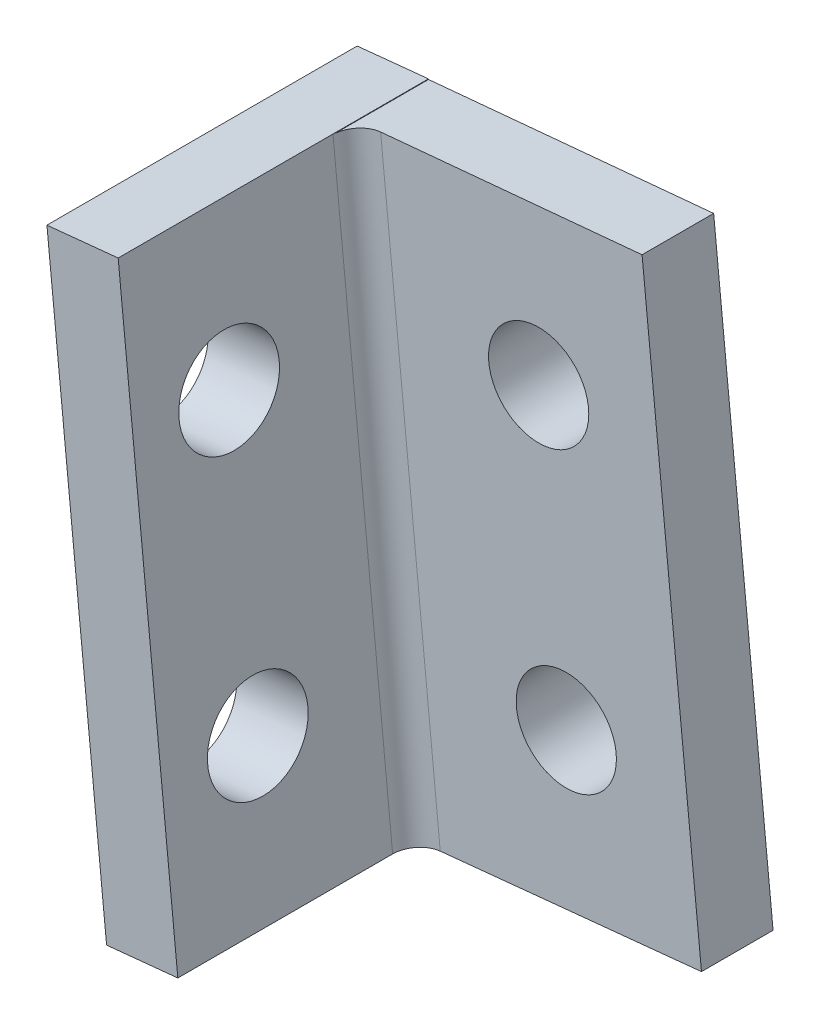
ISO-10303-21;
HEADER;
FILE_DESCRIPTION(('STEP AP214'),'2;1');
FILE_NAME('part.step','',(''),(''),'','','');
FILE_SCHEMA(('AUTOMOTIVE_DESIGN { 1 0 10303 214 1 1 1 1 }'));
ENDSEC;
DATA;
#1=APPLICATION_CONTEXT('core data for automotive mechanical design processes');
#2=APPLICATION_PROTOCOL_DEFINITION('international standard','automotive_design',2000,#1);
#3=PRODUCT_CONTEXT('',#1,'mechanical');
#4=PRODUCT('Part','Part','',(#3));
#5=PRODUCT_RELATED_PRODUCT_CATEGORY('part','',(#4));
#6=PRODUCT_DEFINITION_FORMATION('','',#4);
#7=PRODUCT_DEFINITION_CONTEXT('part definition',#1,'design');
#8=PRODUCT_DEFINITION('design','',#6,#7);
#9=PRODUCT_DEFINITION_SHAPE('','',#8);
#10=(LENGTH_UNIT() NAMED_UNIT(*) SI_UNIT(.MILLI.,.METRE.));
#11=(NAMED_UNIT(*) PLANE_ANGLE_UNIT() SI_UNIT($,.RADIAN.));
#12=(NAMED_UNIT(*) SI_UNIT($,.STERADIAN.) SOLID_ANGLE_UNIT());
#13=UNCERTAINTY_MEASURE_WITH_UNIT(LENGTH_MEASURE(1.E-05),#10,'distance_accuracy_value','');
#14=(GEOMETRIC_REPRESENTATION_CONTEXT(3) GLOBAL_UNCERTAINTY_ASSIGNED_CONTEXT((#13)) GLOBAL_UNIT_ASSIGNED_CONTEXT((#10,
#11,#12)) REPRESENTATION_CONTEXT('',''));
#15=CARTESIAN_POINT('',(0.,0.,0.));
#16=DIRECTION('',(0.,0.,1.));
#17=DIRECTION('',(1.,0.,0.));
#18=AXIS2_PLACEMENT_3D('',#15,#16,#17);
#19=CARTESIAN_POINT('',(0.,0.,3.));
#20=DIRECTION('',(0.,0.,1.));
#21=DIRECTION('',(1.,0.,0.));
#22=AXIS2_PLACEMENT_3D('',#19,#20,#21);
#23=PLANE('',#22);
#24=DIRECTION('',(-0.995676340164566,-0.0928903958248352,0.));
#25=VECTOR('',#24,1.);
#26=CARTESIAN_POINT('',(-90.0648548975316,46.1301648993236,3.));
#27=LINE('',#26,#25);
#28=CARTESIAN_POINT('',(-90.0648548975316,46.1301648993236,3.));
#29=VERTEX_POINT('',#28);
#30=CARTESIAN_POINT('',(-101.017193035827,45.108380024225,3.));
#31=VERTEX_POINT('',#30);
#32=EDGE_CURVE('E156',#29,#31,#27,.T.);
#33=ORIENTED_EDGE('',*,*,#32,.T.);
#34=DIRECTION('',(-0.0999999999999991,0.99498743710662,0.));
#35=VECTOR('',#34,1.);
#36=CARTESIAN_POINT('',(-98.5200502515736,20.2621230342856,3.));
#37=LINE('',#36,#35);
#38=CARTESIAN_POINT('',(-98.5200502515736,20.2621230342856,3.));
#39=VERTEX_POINT('',#38);
#40=EDGE_CURVE('E62',#31,#39,#37,.F.);
#41=ORIENTED_EDGE('',*,*,#40,.T.);
#42=DIRECTION('',(0.99498743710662,0.0999999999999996,0.));
#43=VECTOR('',#42,1.);
#44=CARTESIAN_POINT('',(-102.5,19.8621230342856,3.));
#45=LINE('',#44,#43);
#46=CARTESIAN_POINT('',(-87.5751884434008,21.3621230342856,3.));
#47=VERTEX_POINT('',#46);
#48=EDGE_CURVE('E158',#39,#47,#45,.T.);
#49=ORIENTED_EDGE('',*,*,#48,.T.);
#50=DIRECTION('',(-0.100015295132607,0.994985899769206,0.));
#51=VECTOR('',#50,1.);
#52=CARTESIAN_POINT('',(-87.5751884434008,21.3621230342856,3.));
#53=LINE('',#52,#51);
#54=EDGE_CURVE('E161',#47,#29,#53,.T.);
#55=ORIENTED_EDGE('',*,*,#54,.T.);
#56=EDGE_LOOP('',(#33,#41,#49,#55));
#57=FACE_BOUND('',#56,.T.);
#58=CARTESIAN_POINT('',(-94.3968404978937,39.2338656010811,3.));
#59=DIRECTION('',(0.,0.,1.));
#60=DIRECTION('',(1.,0.,0.));
#61=AXIS2_PLACEMENT_3D('',#58,#59,#60);
#62=CIRCLE('',#61,2.1);
#63=CARTESIAN_POINT('',(-92.2968404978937,39.2338656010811,3.));
#64=VERTEX_POINT('',#63);
#65=EDGE_CURVE('E150',#64,#64,#62,.T.);
#66=ORIENTED_EDGE('',*,*,#65,.F.);
#67=EDGE_LOOP('',(#66));
#68=FACE_BOUND('',#67,.T.);
#69=CARTESIAN_POINT('',(-93.2394907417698,27.2898067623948,3.));
#70=DIRECTION('',(0.,0.,1.));
#71=DIRECTION('',(1.,0.,0.));
#72=AXIS2_PLACEMENT_3D('',#69,#70,#71);
#73=CIRCLE('',#72,2.1);
#74=CARTESIAN_POINT('',(-91.1394907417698,27.2898067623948,3.));
#75=VERTEX_POINT('',#74);
#76=EDGE_CURVE('E144',#75,#75,#73,.T.);
#77=ORIENTED_EDGE('',*,*,#76,.F.);
#78=EDGE_LOOP('',(#77));
#79=FACE_BOUND('',#78,.T.);
#80=ADVANCED_FACE('F41',(#57,#68,#79),#23,.T.);
#81=CARTESIAN_POINT('',(0.,0.,0.));
#82=DIRECTION('',(0.,0.,1.));
#83=DIRECTION('',(1.,0.,0.));
#84=AXIS2_PLACEMENT_3D('',#81,#82,#83);
#85=PLANE('',#84);
#86=DIRECTION('',(-0.100015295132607,0.994985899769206,0.));
#87=VECTOR('',#86,1.);
#88=CARTESIAN_POINT('',(-87.5751884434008,21.3621230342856,0.));
#89=LINE('',#88,#87);
#90=CARTESIAN_POINT('',(-87.5751884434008,21.3621230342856,0.));
#91=VERTEX_POINT('',#90);
#92=CARTESIAN_POINT('',(-90.0648548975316,46.1301648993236,0.));
#93=VERTEX_POINT('',#92);
#94=EDGE_CURVE('E159',#91,#93,#89,.T.);
#95=ORIENTED_EDGE('',*,*,#94,.F.);
#96=DIRECTION('',(0.99498743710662,0.0999999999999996,0.));
#97=VECTOR('',#96,1.);
#98=CARTESIAN_POINT('',(-102.5,19.8621230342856,0.));
#99=LINE('',#98,#97);
#100=CARTESIAN_POINT('',(-102.5,19.8621230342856,0.));
#101=VERTEX_POINT('',#100);
#102=EDGE_CURVE('E168',#101,#91,#99,.T.);
#103=ORIENTED_EDGE('',*,*,#102,.F.);
#104=DIRECTION('',(0.0999999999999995,-0.99498743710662,0.));
#105=VECTOR('',#104,1.);
#106=CARTESIAN_POINT('',(-105.,44.7368089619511,0.));
#107=LINE('',#106,#105);
#108=CARTESIAN_POINT('',(-105.,44.7368089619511,0.));
#109=VERTEX_POINT('',#108);
#110=EDGE_CURVE('E166',#109,#101,#107,.T.);
#111=ORIENTED_EDGE('',*,*,#110,.F.);
#112=DIRECTION('',(-0.99498743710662,-0.0999999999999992,0.));
#113=VECTOR('',#112,1.);
#114=CARTESIAN_POINT('',(-102.01503768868,45.0368089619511,0.));
#115=LINE('',#114,#113);
#116=CARTESIAN_POINT('',(-102.01503768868,45.0368089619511,0.));
#117=VERTEX_POINT('',#116);
#118=EDGE_CURVE('E138',#117,#109,#115,.T.);
#119=ORIENTED_EDGE('',*,*,#118,.F.);
#120=DIRECTION('',(0.0999999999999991,-0.99498743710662,0.));
#121=VECTOR('',#120,1.);
#122=CARTESIAN_POINT('',(-99.5150376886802,20.1621230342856,0.));
#123=LINE('',#122,#121);
#124=CARTESIAN_POINT('',(-102.01289477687,45.0154872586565,0.));
#125=VERTEX_POINT('',#124);
#126=EDGE_CURVE('E117',#117,#125,#123,.T.);
#127=ORIENTED_EDGE('',*,*,#126,.T.);
#128=DIRECTION('',(-0.995676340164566,-0.0928903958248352,0.));
#129=VECTOR('',#128,1.);
#130=CARTESIAN_POINT('',(-90.0648548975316,46.1301648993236,0.));
#131=LINE('',#130,#129);
#132=EDGE_CURVE('E153',#93,#125,#131,.T.);
#133=ORIENTED_EDGE('',*,*,#132,.F.);
#134=EDGE_LOOP('',(#95,#103,#111,#119,#127,#133));
#135=FACE_BOUND('',#134,.T.);
#136=CARTESIAN_POINT('',(-94.3968404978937,39.2338656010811,0.));
#137=DIRECTION('',(0.,0.,1.));
#138=DIRECTION('',(1.,0.,0.));
#139=AXIS2_PLACEMENT_3D('',#136,#137,#138);
#140=CIRCLE('',#139,2.1);
#141=CARTESIAN_POINT('',(-92.2968404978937,39.2338656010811,0.));
#142=VERTEX_POINT('',#141);
#143=EDGE_CURVE('E147',#142,#142,#140,.T.);
#144=ORIENTED_EDGE('',*,*,#143,.T.);
#145=EDGE_LOOP('',(#144));
#146=FACE_BOUND('',#145,.T.);
#147=CARTESIAN_POINT('',(-93.2394907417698,27.2898067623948,0.));
#148=DIRECTION('',(0.,0.,1.));
#149=DIRECTION('',(1.,0.,0.));
#150=AXIS2_PLACEMENT_3D('',#147,#148,#149);
#151=CIRCLE('',#150,2.1);
#152=CARTESIAN_POINT('',(-91.1394907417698,27.2898067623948,0.));
#153=VERTEX_POINT('',#152);
#154=EDGE_CURVE('E143',#153,#153,#151,.T.);
#155=ORIENTED_EDGE('',*,*,#154,.T.);
#156=EDGE_LOOP('',(#155));
#157=FACE_BOUND('',#156,.T.);
#158=ADVANCED_FACE('F195',(#135,#146,#157),#85,.F.);
#159=CARTESIAN_POINT('',(-90.0648548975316,46.1301648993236,3.));
#160=DIRECTION('',(0.0928903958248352,-0.995676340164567,0.));
#161=DIRECTION('',(0.995676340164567,0.0928903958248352,0.));
#162=AXIS2_PLACEMENT_3D('',#159,#160,#161);
#163=PLANE('',#162);
#164=ORIENTED_EDGE('',*,*,#132,.T.);
#165=DIRECTION('',(0.,0.,1.));
#166=VECTOR('',#165,1.);
#167=CARTESIAN_POINT('',(-102.012894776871,45.0154872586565,3.));
#168=LINE('',#167,#166);
#169=CARTESIAN_POINT('',(-102.012894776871,45.0154872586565,4.));
#170=VERTEX_POINT('',#169);
#171=EDGE_CURVE('E140',#125,#170,#168,.T.);
#172=ORIENTED_EDGE('',*,*,#171,.T.);
#173=CARTESIAN_POINT('',(-101.017193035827,45.108380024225,4.));
#174=DIRECTION('',(0.0928903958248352,-0.995676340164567,0.));
#175=DIRECTION('',(0.995676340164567,0.0928903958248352,0.));
#176=AXIS2_PLACEMENT_3D('',#173,#174,#175);
#177=ELLIPSE('',#176,1.00002551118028,1.);
#178=EDGE_CURVE('E49',#170,#31,#177,.T.);
#179=ORIENTED_EDGE('',*,*,#178,.T.);
#180=ORIENTED_EDGE('',*,*,#32,.F.);
#181=DIRECTION('',(0.,0.,-1.));
#182=VECTOR('',#181,1.);
#183=CARTESIAN_POINT('',(-90.0648548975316,46.1301648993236,3.));
#184=LINE('',#183,#182);
#185=EDGE_CURVE('E163',#29,#93,#184,.T.);
#186=ORIENTED_EDGE('',*,*,#185,.T.);
#187=EDGE_LOOP('',(#164,#172,#179,#180,#186));
#188=FACE_BOUND('',#187,.T.);
#189=ADVANCED_FACE('F201',(#188),#163,.F.);
#190=CARTESIAN_POINT('',(-105.,44.7368089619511,3.));
#191=DIRECTION('',(0.99498743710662,0.0999999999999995,0.));
#192=DIRECTION('',(-0.0999999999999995,0.99498743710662,0.));
#193=AXIS2_PLACEMENT_3D('',#190,#191,#192);
#194=PLANE('',#193);
#195=ORIENTED_EDGE('',*,*,#110,.T.);
#196=DIRECTION('',(0.,0.,-1.));
#197=VECTOR('',#196,1.);
#198=CARTESIAN_POINT('',(-102.5,19.8621230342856,3.));
#199=LINE('',#198,#197);
#200=CARTESIAN_POINT('',(-102.5,19.8621230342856,13.));
#201=VERTEX_POINT('',#200);
#202=EDGE_CURVE('E176',#201,#101,#199,.T.);
#203=ORIENTED_EDGE('',*,*,#202,.F.);
#204=DIRECTION('',(-0.0999999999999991,0.99498743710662,0.));
#205=VECTOR('',#204,1.);
#206=CARTESIAN_POINT('',(-102.5,19.8621230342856,13.));
#207=LINE('',#206,#205);
#208=CARTESIAN_POINT('',(-105.,44.7368089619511,13.));
#209=VERTEX_POINT('',#208);
#210=EDGE_CURVE('E125',#201,#209,#207,.T.);
#211=ORIENTED_EDGE('',*,*,#210,.T.);
#212=DIRECTION('',(0.,0.,-1.));
#213=VECTOR('',#212,1.);
#214=CARTESIAN_POINT('',(-105.,44.7368089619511,3.));
#215=LINE('',#214,#213);
#216=EDGE_CURVE('E178',#209,#109,#215,.T.);
#217=ORIENTED_EDGE('',*,*,#216,.T.);
#218=EDGE_LOOP('',(#195,#203,#211,#217));
#219=FACE_BOUND('',#218,.T.);
#220=CARTESIAN_POINT('',(-104.35,38.2693906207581,9.));
#221=DIRECTION('',(-0.99498743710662,-0.0999999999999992,0.));
#222=DIRECTION('',(0.0999999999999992,-0.99498743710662,0.));
#223=AXIS2_PLACEMENT_3D('',#220,#221,#222);
#224=CIRCLE('',#223,2.09999999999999);
#225=CARTESIAN_POINT('',(-104.14,36.1799170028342,9.));
#226=VERTEX_POINT('',#225);
#227=EDGE_CURVE('E233',#226,#226,#224,.T.);
#228=ORIENTED_EDGE('',*,*,#227,.F.);
#229=EDGE_LOOP('',(#228));
#230=FACE_BOUND('',#229,.T.);
#231=CARTESIAN_POINT('',(-103.15,26.3295413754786,9.));
#232=DIRECTION('',(-0.99498743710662,-0.0999999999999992,0.));
#233=DIRECTION('',(0.0999999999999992,-0.99498743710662,0.));
#234=AXIS2_PLACEMENT_3D('',#231,#232,#233);
#235=CIRCLE('',#234,2.09999999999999);
#236=CARTESIAN_POINT('',(-102.94,24.2400677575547,9.));
#237=VERTEX_POINT('',#236);
#238=EDGE_CURVE('E227',#237,#237,#235,.T.);
#239=ORIENTED_EDGE('',*,*,#238,.F.);
#240=EDGE_LOOP('',(#239));
#241=FACE_BOUND('',#240,.T.);
#242=ADVANCED_FACE('F215',(#219,#230,#241),#194,.F.);
#243=CARTESIAN_POINT('',(-102.5,19.8621230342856,3.));
#244=DIRECTION('',(-0.0999999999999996,0.99498743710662,0.));
#245=DIRECTION('',(-0.99498743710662,-0.0999999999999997,0.));
#246=AXIS2_PLACEMENT_3D('',#243,#244,#245);
#247=PLANE('',#246);
#248=ORIENTED_EDGE('',*,*,#48,.F.);
#249=CARTESIAN_POINT('',(-98.5200502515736,20.2621230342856,4.));
#250=DIRECTION('',(-0.0999999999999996,0.99498743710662,0.));
#251=DIRECTION('',(-0.99498743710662,-0.0999999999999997,0.));
#252=AXIS2_PLACEMENT_3D('',#249,#250,#251);
#253=CIRCLE('',#252,1.);
#254=CARTESIAN_POINT('',(-99.5150376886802,20.1621230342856,4.));
#255=VERTEX_POINT('',#254);
#256=EDGE_CURVE('E11',#39,#255,#253,.T.);
#257=ORIENTED_EDGE('',*,*,#256,.T.);
#258=DIRECTION('',(0.,0.,1.));
#259=VECTOR('',#258,1.);
#260=CARTESIAN_POINT('',(-99.5150376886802,20.1621230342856,0.));
#261=LINE('',#260,#259);
#262=CARTESIAN_POINT('',(-99.5150376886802,20.1621230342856,13.));
#263=VERTEX_POINT('',#262);
#264=EDGE_CURVE('E105',#255,#263,#261,.T.);
#265=ORIENTED_EDGE('',*,*,#264,.T.);
#266=DIRECTION('',(-0.99498743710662,-0.0999999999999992,0.));
#267=VECTOR('',#266,1.);
#268=CARTESIAN_POINT('',(-99.5150376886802,20.1621230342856,13.));
#269=LINE('',#268,#267);
#270=EDGE_CURVE('E109',#263,#201,#269,.T.);
#271=ORIENTED_EDGE('',*,*,#270,.T.);
#272=ORIENTED_EDGE('',*,*,#202,.T.);
#273=ORIENTED_EDGE('',*,*,#102,.T.);
#274=DIRECTION('',(0.,0.,-1.));
#275=VECTOR('',#274,1.);
#276=CARTESIAN_POINT('',(-87.5751884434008,21.3621230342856,3.));
#277=LINE('',#276,#275);
#278=EDGE_CURVE('E173',#47,#91,#277,.T.);
#279=ORIENTED_EDGE('',*,*,#278,.F.);
#280=EDGE_LOOP('',(#248,#257,#265,#271,#272,#273,#279));
#281=FACE_BOUND('',#280,.T.);
#282=ADVANCED_FACE('F107',(#281),#247,.F.);
#283=CARTESIAN_POINT('',(-87.5751884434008,21.3621230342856,3.));
#284=DIRECTION('',(-0.994985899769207,-0.100015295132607,0.));
#285=DIRECTION('',(0.100015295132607,-0.994985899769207,0.));
#286=AXIS2_PLACEMENT_3D('',#283,#284,#285);
#287=PLANE('',#286);
#288=ORIENTED_EDGE('',*,*,#94,.T.);
#289=ORIENTED_EDGE('',*,*,#185,.F.);
#290=ORIENTED_EDGE('',*,*,#54,.F.);
#291=ORIENTED_EDGE('',*,*,#278,.T.);
#292=EDGE_LOOP('',(#288,#289,#290,#291));
#293=FACE_BOUND('',#292,.T.);
#294=ADVANCED_FACE('F209',(#293),#287,.F.);
#295=CARTESIAN_POINT('',(-94.3968404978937,39.2338656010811,3.));
#296=DIRECTION('',(0.,0.,-1.));
#297=DIRECTION('',(-1.,0.,0.));
#298=AXIS2_PLACEMENT_3D('',#295,#296,#297);
#299=CYLINDRICAL_SURFACE('',#298,2.1);
#300=ORIENTED_EDGE('',*,*,#65,.T.);
#301=EDGE_LOOP('',(#300));
#302=FACE_BOUND('',#301,.T.);
#303=ORIENTED_EDGE('',*,*,#143,.F.);
#304=EDGE_LOOP('',(#303));
#305=FACE_BOUND('',#304,.T.);
#306=ADVANCED_FACE('F206',(#302,#305),#299,.F.);
#307=CARTESIAN_POINT('',(-93.2394907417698,27.2898067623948,3.));
#308=DIRECTION('',(0.,0.,-1.));
#309=DIRECTION('',(-1.,0.,0.));
#310=AXIS2_PLACEMENT_3D('',#307,#308,#309);
#311=CYLINDRICAL_SURFACE('',#310,2.1);
#312=ORIENTED_EDGE('',*,*,#76,.T.);
#313=EDGE_LOOP('',(#312));
#314=FACE_BOUND('',#313,.T.);
#315=ORIENTED_EDGE('',*,*,#154,.F.);
#316=EDGE_LOOP('',(#315));
#317=FACE_BOUND('',#316,.T.);
#318=ADVANCED_FACE('F258',(#314,#317),#311,.F.);
#319=CARTESIAN_POINT('',(-102.01503768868,45.0368089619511,0.));
#320=DIRECTION('',(-0.0999999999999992,0.99498743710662,0.));
#321=DIRECTION('',(-0.99498743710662,-0.0999999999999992,0.));
#322=AXIS2_PLACEMENT_3D('',#319,#320,#321);
#323=PLANE('',#322);
#324=ORIENTED_EDGE('',*,*,#216,.F.);
#325=DIRECTION('',(-0.99498743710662,-0.0999999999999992,0.));
#326=VECTOR('',#325,1.);
#327=CARTESIAN_POINT('',(-102.01503768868,45.0368089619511,13.));
#328=LINE('',#327,#326);
#329=CARTESIAN_POINT('',(-102.01503768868,45.0368089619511,13.));
#330=VERTEX_POINT('',#329);
#331=EDGE_CURVE('E126',#330,#209,#328,.T.);
#332=ORIENTED_EDGE('',*,*,#331,.F.);
#333=DIRECTION('',(0.,0.,-1.));
#334=VECTOR('',#333,1.);
#335=CARTESIAN_POINT('',(-102.01503768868,45.0368089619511,0.));
#336=LINE('',#335,#334);
#337=EDGE_CURVE('E127',#330,#117,#336,.T.);
#338=ORIENTED_EDGE('',*,*,#337,.T.);
#339=ORIENTED_EDGE('',*,*,#118,.T.);
#340=EDGE_LOOP('',(#324,#332,#338,#339));
#341=FACE_BOUND('',#340,.T.);
#342=ADVANCED_FACE('F255',(#341),#323,.T.);
#343=CARTESIAN_POINT('',(-99.5150376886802,20.1621230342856,13.));
#344=DIRECTION('',(0.,0.,1.));
#345=DIRECTION('',(0.,-1.,0.));
#346=AXIS2_PLACEMENT_3D('',#343,#344,#345);
#347=PLANE('',#346);
#348=ORIENTED_EDGE('',*,*,#210,.F.);
#349=ORIENTED_EDGE('',*,*,#270,.F.);
#350=DIRECTION('',(-0.0999999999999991,0.99498743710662,0.));
#351=VECTOR('',#350,1.);
#352=CARTESIAN_POINT('',(-99.5150376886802,20.1621230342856,13.));
#353=LINE('',#352,#351);
#354=EDGE_CURVE('E116',#263,#330,#353,.T.);
#355=ORIENTED_EDGE('',*,*,#354,.T.);
#356=ORIENTED_EDGE('',*,*,#331,.T.);
#357=EDGE_LOOP('',(#348,#349,#355,#356));
#358=FACE_BOUND('',#357,.T.);
#359=ADVANCED_FACE('F121',(#358),#347,.T.);
#360=CARTESIAN_POINT('',(-96.5137813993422,-9.69999999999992,0.));
#361=DIRECTION('',(0.99498743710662,0.0999999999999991,0.));
#362=DIRECTION('',(-0.0999999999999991,0.99498743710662,0.));
#363=AXIS2_PLACEMENT_3D('',#360,#361,#362);
#364=PLANE('',#363);
#365=CARTESIAN_POINT('',(-101.36503768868,38.569390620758,9.));
#366=DIRECTION('',(-0.99498743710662,-0.0999999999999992,0.));
#367=DIRECTION('',(0.0999999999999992,-0.99498743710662,0.));
#368=AXIS2_PLACEMENT_3D('',#365,#366,#367);
#369=CIRCLE('',#368,2.09999999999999);
#370=CARTESIAN_POINT('',(-101.15503768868,36.4799170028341,9.));
#371=VERTEX_POINT('',#370);
#372=EDGE_CURVE('E230',#371,#371,#369,.T.);
#373=ORIENTED_EDGE('',*,*,#372,.T.);
#374=EDGE_LOOP('',(#373));
#375=FACE_BOUND('',#374,.T.);
#376=CARTESIAN_POINT('',(-100.16503768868,26.6295413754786,9.));
#377=DIRECTION('',(-0.99498743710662,-0.0999999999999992,0.));
#378=DIRECTION('',(0.0999999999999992,-0.99498743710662,0.));
#379=AXIS2_PLACEMENT_3D('',#376,#377,#378);
#380=CIRCLE('',#379,2.09999999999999);
#381=CARTESIAN_POINT('',(-99.9550376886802,24.5400677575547,9.));
#382=VERTEX_POINT('',#381);
#383=EDGE_CURVE('E137',#382,#382,#380,.T.);
#384=ORIENTED_EDGE('',*,*,#383,.T.);
#385=EDGE_LOOP('',(#384));
#386=FACE_BOUND('',#385,.T.);
#387=ORIENTED_EDGE('',*,*,#264,.F.);
#388=DIRECTION('',(-0.0999999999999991,0.99498743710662,0.));
#389=VECTOR('',#388,1.);
#390=CARTESIAN_POINT('',(-102.012894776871,45.0154872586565,4.));
#391=LINE('',#390,#389);
#392=EDGE_CURVE('E181',#255,#170,#391,.T.);
#393=ORIENTED_EDGE('',*,*,#392,.T.);
#394=ORIENTED_EDGE('',*,*,#171,.F.);
#395=ORIENTED_EDGE('',*,*,#126,.F.);
#396=ORIENTED_EDGE('',*,*,#337,.F.);
#397=ORIENTED_EDGE('',*,*,#354,.F.);
#398=EDGE_LOOP('',(#387,#393,#394,#395,#396,#397));
#399=FACE_BOUND('',#398,.T.);
#400=ADVANCED_FACE('F129',(#375,#386,#399),#364,.T.);
#401=CARTESIAN_POINT('',(-100.16503768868,26.6295413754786,9.));
#402=DIRECTION('',(-0.99498743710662,-0.0999999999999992,0.));
#403=DIRECTION('',(0.0999999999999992,-0.99498743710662,0.));
#404=AXIS2_PLACEMENT_3D('',#401,#402,#403);
#405=CYLINDRICAL_SURFACE('',#404,2.09999999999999);
#406=ORIENTED_EDGE('',*,*,#383,.F.);
#407=EDGE_LOOP('',(#406));
#408=FACE_BOUND('',#407,.T.);
#409=ORIENTED_EDGE('',*,*,#238,.T.);
#410=EDGE_LOOP('',(#409));
#411=FACE_BOUND('',#410,.T.);
#412=ADVANCED_FACE('F191',(#408,#411),#405,.F.);
#413=CARTESIAN_POINT('',(-101.36503768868,38.569390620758,9.));
#414=DIRECTION('',(-0.99498743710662,-0.0999999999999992,0.));
#415=DIRECTION('',(0.0999999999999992,-0.99498743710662,0.));
#416=AXIS2_PLACEMENT_3D('',#413,#414,#415);
#417=CYLINDRICAL_SURFACE('',#416,2.09999999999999);
#418=ORIENTED_EDGE('',*,*,#372,.F.);
#419=EDGE_LOOP('',(#418));
#420=FACE_BOUND('',#419,.T.);
#421=ORIENTED_EDGE('',*,*,#227,.T.);
#422=EDGE_LOOP('',(#421));
#423=FACE_BOUND('',#422,.T.);
#424=ADVANCED_FACE('F186',(#420,#423),#417,.F.);
#425=CARTESIAN_POINT('',(-95.5187939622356,-9.59999999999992,4.));
#426=DIRECTION('',(0.0999999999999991,-0.99498743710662,0.));
#427=DIRECTION('',(0.99498743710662,0.0999999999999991,0.));
#428=AXIS2_PLACEMENT_3D('',#425,#426,#427);
#429=CYLINDRICAL_SURFACE('',#428,1.);
#430=ORIENTED_EDGE('',*,*,#256,.F.);
#431=ORIENTED_EDGE('',*,*,#40,.F.);
#432=ORIENTED_EDGE('',*,*,#178,.F.);
#433=ORIENTED_EDGE('',*,*,#392,.F.);
#434=EDGE_LOOP('',(#430,#431,#432,#433));
#435=FACE_BOUND('',#434,.T.);
#436=ADVANCED_FACE('F43',(#435),#429,.F.);
#437=CLOSED_SHELL('',(#80,#158,#189,#242,#282,#294,#306,#318,#342,#359,#400,#412,#424,#436));
#438=MANIFOLD_SOLID_BREP('B2',#437);
#439=ADVANCED_BREP_SHAPE_REPRESENTATION('',(#18,#438),#14);
#440=SHAPE_DEFINITION_REPRESENTATION(#9,#439);
ENDSEC;
END-ISO-10303-21;
